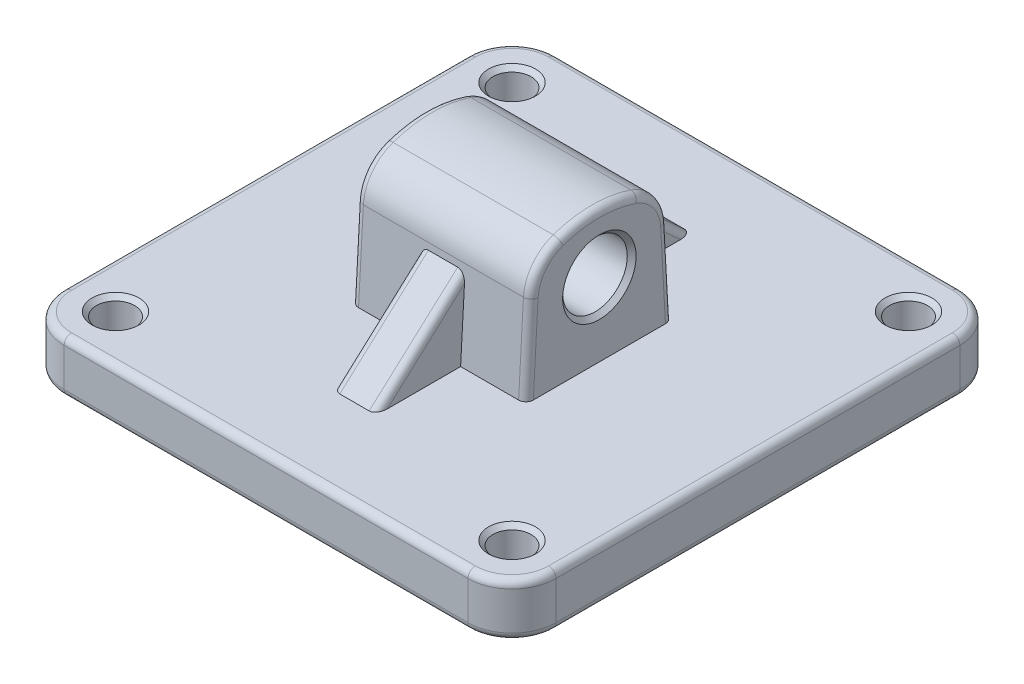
from build123d import *

# Parameters (mm, degrees)
IZIM2_R                     = 13
Y_KSEKLIK_EKSTR_ZYON1_DEPTH = 36
IZIM20_R                    = 120
KES_EKSTR_ZYON3_DEPTH       = 15
KES_EKSTR_ZYON3_DRAFT       = -22
IZIM25_R                    = 22
Y_KSEKLIK_EKSTR_ZYON3_DEPTH = 119
FEDER2_REACH                = 270.363
IZIM26_WALL_W               = 620.584306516
IZIM26_WALL_H               = 30
RADYUS1_R                   = 5
PAH1_SIZE                   = 3


with BuildPart() as part:
    # izim2 → Y_kseklik-Ekstr_zyon1 (new body)
    with BuildSketch(Plane(origin=(0, 0, 0), x_dir=(1, 0, 0), z_dir=(0, 1, 0))):
        with BuildLine():
            Line((-167.5, 137.5), (-167.5, -137.5))
            ThreePointArc((-167.5, -137.5), (-158.713203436, -158.713203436), (-137.5, -167.5))
            Line((-137.5, -167.5), (137.5, -167.5))
            ThreePointArc((137.5, -167.5), (158.713203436, -158.713203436), (167.5, -137.5))
            Line((167.5, -137.5), (167.5, 137.5))
            ThreePointArc((167.5, 137.5), (158.713203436, 158.713203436), (137.5, 167.5))
            Line((137.5, 167.5), (-137.5, 167.5))
            ThreePointArc((-137.5, 167.5), (-158.713203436, 158.713203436), (-167.5, 137.5))
        make_face()
        with Locations(Location((-135, 135, 0), (0, 0, 270))):
            Circle(IZIM2_R, mode=Mode.SUBTRACT)
        with Locations(Location((135, 135, 0), (0, 0, 90))):
            Circle(IZIM2_R, mode=Mode.SUBTRACT)
        with Locations(Location((135, -135, 0), (0, 0, 270))):
            Circle(IZIM2_R, mode=Mode.SUBTRACT)
        with Locations(Location((-135, -135, 0), (0, 0, 90))):
            Circle(IZIM2_R, mode=Mode.SUBTRACT)
    extrude(amount=Y_KSEKLIK_EKSTR_ZYON1_DEPTH)


with BuildPart() as kes_ekstr_zyon3_tool:
    # izim20 → Kes-Ekstr_zyon3 (with draft: the straight prism first)
    with BuildSketch(Plane.XZ):
        Circle(IZIM20_R)
    extrude(amount=-KES_EKSTR_ZYON3_DEPTH)
    # Kes-Ekstr_zyon3: the draft: its side faces are tilted about the plane it starts from
    kes_ekstr_zyon3_sides = [kes_ekstr_zyon3_tool.faces().sort_by_distance(p)[0] for p in [
        (-120, 7.5, 0),
    ]]
    draft(kes_ekstr_zyon3_sides, Plane.XZ, KES_EKSTR_ZYON3_DRAFT)


with BuildPart() as part_1:
    add(part.part)

    # Kes-Ekstr_zyon3: cut by kes_ekstr_zyon3_tool
    add(kes_ekstr_zyon3_tool.part, mode=Mode.SUBTRACT)

    # izim25 → Y_kseklik-Ekstr_zyon3 (add)
    with BuildSketch(Plane(origin=(59.5, 0, 0), x_dir=(0, 0, -1), z_dir=(1, 0, 0))):
        with BuildLine():
            Line((-50, 36), (50, 36))
            Line((50, 36), (46.726787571, 94.995886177))
            ThreePointArc((46.726787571, 94.995886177), (40.681587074, 111.455033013), (26.468952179, 121.723868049))
            ThreePointArc((26.468952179, 121.723868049), (0, 126.1192444), (-26.468952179, 121.723868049))
            ThreePointArc((-26.468952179, 121.723868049), (-40.681587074, 111.455033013), (-46.726787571, 94.995886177))
            Line((-46.726787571, 94.995886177), (-50, 36))
        make_face()
        with Locations((0, 86)):
            Circle(IZIM25_R, mode=Mode.SUBTRACT)
    extrude(amount=-Y_KSEKLIK_EKSTR_ZYON3_DEPTH)

    # izim26 wall → Feder2 (add, up to next)
    with BuildSketch(Plane(origin=(0, 63.138980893, -77.313514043), x_dir=(0, -0.671112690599, -0.741355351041), z_dir=(0, 0.741355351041, -0.671112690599)), mode=Mode.PRIVATE) as feder2_sk1:
        Rectangle(IZIM26_WALL_W, IZIM26_WALL_H)
    feder2_tool1 = extrude(feder2_sk1.sketch, amount=-FEDER2_REACH, mode=Mode.PRIVATE) - part_1.part
    feder2 = feder2_tool1.solids().sort_by_distance((0, 63.138980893, -77.313514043))[0]
    add(feder2)

    # Aynalama3: Feder2 across plane
    add(feder2.mirror(Plane.XY))

    # Radyus1
    radyus1_edges = [part_1.edges().sort_by_distance(p)[0] for p in [
        (-158.713203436, 36, 158.713203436),
        (-167.5, 0, 0),
        (-158.713203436, 0, -158.713203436),
        (-15, 63.303612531, 77.131651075),
        (15, 63.303612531, 77.131651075),
        (0, 36, 167.5),
        (158.713203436, 36, 158.713203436),
        (167.5, 36, 0),
        (158.713203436, 36, -158.713203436),
        (0, 36, -167.5),
        (-158.713203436, 36, -158.713203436),
        (-59.5, 111.455033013, -40.681587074),
        (-59.5, 65.497943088, -48.363393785),
        (-59.5, 65.497943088, 48.363393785),
        (-59.5, 111.455033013, 40.681587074),
        (-59.5, 126.1192444, 0),
        (59.5, 111.455033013, -40.681587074),
        (59.5, 126.1192444, 0),
        (59.5, 111.455033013, 40.681587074),
        (59.5, 65.497943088, 48.363393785),
        (59.5, 65.497943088, -48.363393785),
        (-167.5, 36, 0),
        (0, 0, -167.5),
        (15, 63.303612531, -77.131651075),
        (158.713203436, 0, -158.713203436),
        (167.5, 0, 0),
        (-15, 63.303612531, -77.131651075),
        (158.713203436, 0, 158.713203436),
        (0, 0, 167.5),
        (-158.713203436, 0, 158.713203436),
    ]]
    fillet(radyus1_edges, radius=RADYUS1_R)

    # Pah1
    pah1_edges = [part_1.edges().sort_by_distance(p)[0] for p in [
        (-135, 0, -148),
        (-135, 36, -148),
        (135, 0, -122),
        (135, 36, -122),
        (135, 0, 122),
        (135, 36, 122),
        (-135, 0, 148),
        (-135, 36, 148),
        (-59.5, 86, 22),
        (59.5, 86, 22),
    ]]
    chamfer(pah1_edges, length=PAH1_SIZE)


solid = part_1.part
